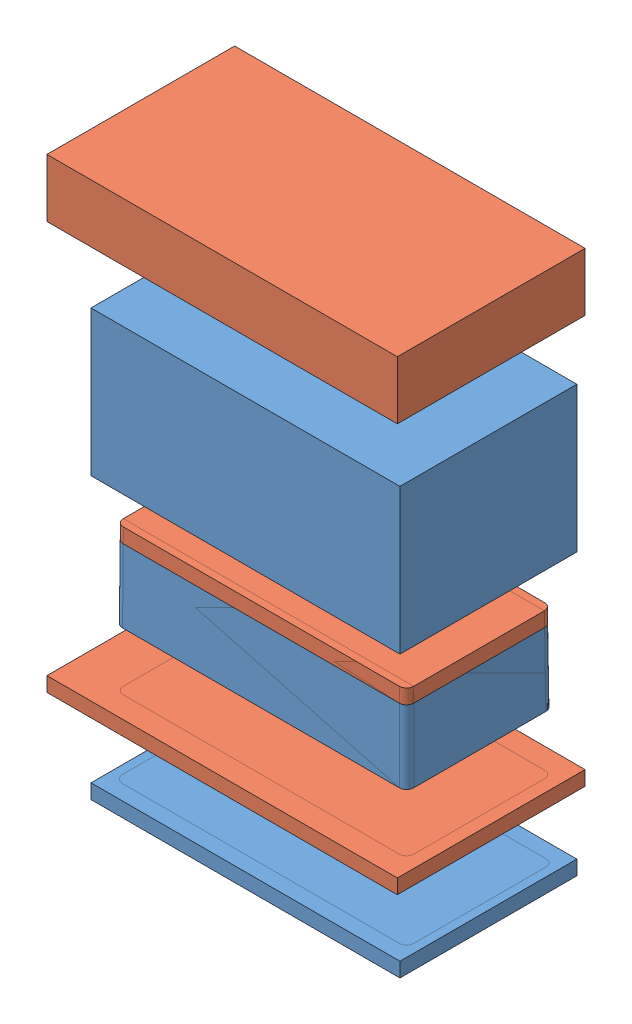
SolidWorks assembly Assem1.SLDASM, configuration Default (file format 13000). Lengths in mm.
Overall size (241.17 373.37 129.2).
2 component instances, 2 part files, 1 mates.
Components (placement in the parent):
- base_1-1: base_1.SLDPRT [Default] at (53.7665 85.1543 177.595) size (212.65 293.01 121.74)
- lid-3: lid.SLDPRT [Default] at (-414.8155 135.1543 626.4086) size (241.17 320.65 129.2)
Mates (geometry in assembly coordinates):
- Coincident4: coincident anti-aligned: plane of base_1-1 through (53.7665 135.1543 177.595) normal (0 1 0); plane of lid-3 through (148.7664 135.1543 132.5952) normal (0 -1 0)
